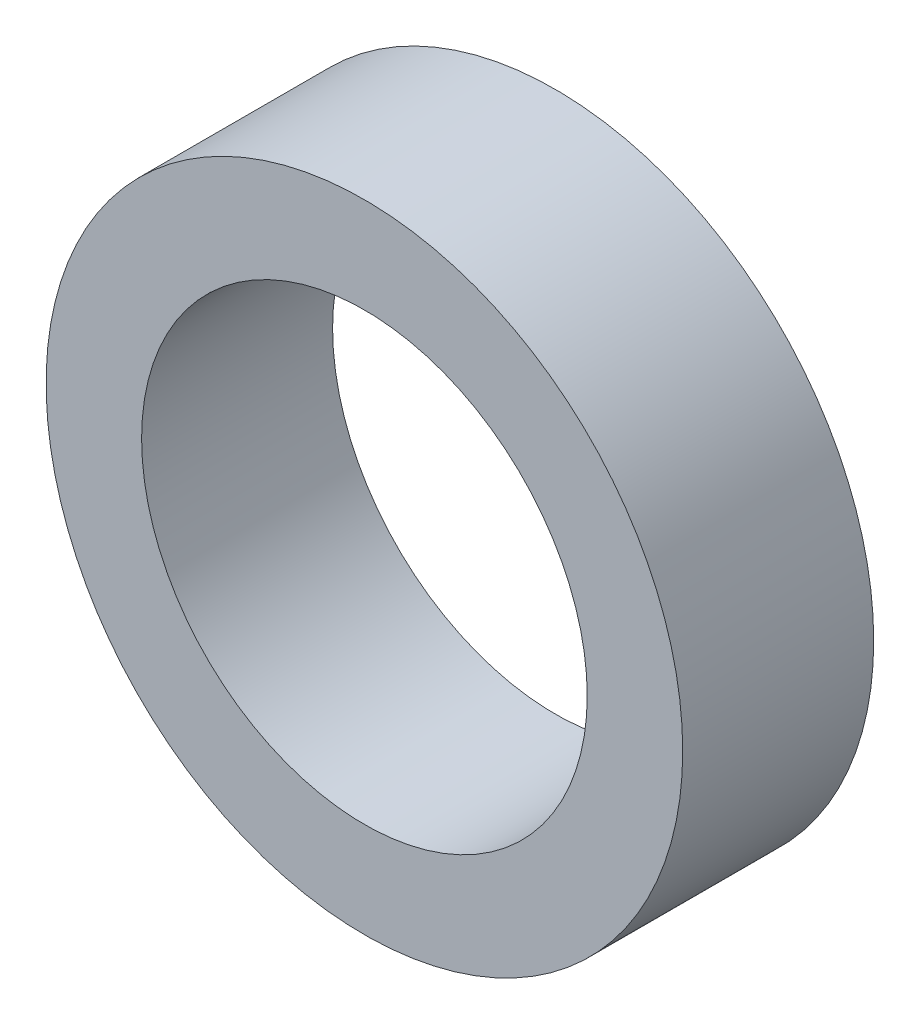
ISO-10303-21;
HEADER;
FILE_DESCRIPTION(('STEP AP214'),'2;1');
FILE_NAME('part.step','',(''),(''),'','','');
FILE_SCHEMA(('AUTOMOTIVE_DESIGN { 1 0 10303 214 1 1 1 1 }'));
ENDSEC;
DATA;
#1=APPLICATION_CONTEXT('core data for automotive mechanical design processes');
#2=APPLICATION_PROTOCOL_DEFINITION('international standard','automotive_design',2000,#1);
#3=PRODUCT_CONTEXT('',#1,'mechanical');
#4=PRODUCT('Part','Part','',(#3));
#5=PRODUCT_RELATED_PRODUCT_CATEGORY('part','',(#4));
#6=PRODUCT_DEFINITION_FORMATION('','',#4);
#7=PRODUCT_DEFINITION_CONTEXT('part definition',#1,'design');
#8=PRODUCT_DEFINITION('design','',#6,#7);
#9=PRODUCT_DEFINITION_SHAPE('','',#8);
#10=(LENGTH_UNIT() NAMED_UNIT(*) SI_UNIT(.MILLI.,.METRE.));
#11=(NAMED_UNIT(*) PLANE_ANGLE_UNIT() SI_UNIT($,.RADIAN.));
#12=(NAMED_UNIT(*) SI_UNIT($,.STERADIAN.) SOLID_ANGLE_UNIT());
#13=UNCERTAINTY_MEASURE_WITH_UNIT(LENGTH_MEASURE(1.E-05),#10,'distance_accuracy_value','');
#14=(GEOMETRIC_REPRESENTATION_CONTEXT(3) GLOBAL_UNCERTAINTY_ASSIGNED_CONTEXT((#13)) GLOBAL_UNIT_ASSIGNED_CONTEXT((#10,
#11,#12)) REPRESENTATION_CONTEXT('',''));
#15=CARTESIAN_POINT('',(0.,0.,0.));
#16=DIRECTION('',(0.,0.,1.));
#17=DIRECTION('',(1.,0.,0.));
#18=AXIS2_PLACEMENT_3D('',#15,#16,#17);
#19=CARTESIAN_POINT('',(0.,0.,1.8));
#20=DIRECTION('',(0.,0.,1.));
#21=DIRECTION('',(1.,0.,0.));
#22=AXIS2_PLACEMENT_3D('',#19,#20,#21);
#23=PLANE('',#22);
#24=CARTESIAN_POINT('',(0.,0.,1.8));
#25=DIRECTION('',(0.,0.,1.));
#26=DIRECTION('',(1.,0.,0.));
#27=AXIS2_PLACEMENT_3D('',#24,#25,#26);
#28=CIRCLE('',#27,3.);
#29=CARTESIAN_POINT('',(3.,0.,1.8));
#30=VERTEX_POINT('',#29);
#31=EDGE_CURVE('E10',#30,#30,#28,.T.);
#32=ORIENTED_EDGE('',*,*,#31,.T.);
#33=EDGE_LOOP('',(#32));
#34=FACE_BOUND('',#33,.T.);
#35=CARTESIAN_POINT('',(0.,0.,1.8));
#36=DIRECTION('',(0.,0.,1.));
#37=DIRECTION('',(1.,0.,0.));
#38=AXIS2_PLACEMENT_3D('',#35,#36,#37);
#39=CIRCLE('',#38,2.1);
#40=CARTESIAN_POINT('',(2.1,0.,1.8));
#41=VERTEX_POINT('',#40);
#42=EDGE_CURVE('E42',#41,#41,#39,.T.);
#43=ORIENTED_EDGE('',*,*,#42,.F.);
#44=EDGE_LOOP('',(#43));
#45=FACE_BOUND('',#44,.T.);
#46=ADVANCED_FACE('F31',(#34,#45),#23,.T.);
#47=CARTESIAN_POINT('',(0.,0.,0.));
#48=DIRECTION('',(0.,0.,1.));
#49=DIRECTION('',(1.,0.,0.));
#50=AXIS2_PLACEMENT_3D('',#47,#48,#49);
#51=PLANE('',#50);
#52=CARTESIAN_POINT('',(0.,0.,0.));
#53=DIRECTION('',(0.,0.,1.));
#54=DIRECTION('',(1.,0.,0.));
#55=AXIS2_PLACEMENT_3D('',#52,#53,#54);
#56=CIRCLE('',#55,3.);
#57=CARTESIAN_POINT('',(3.,0.,0.));
#58=VERTEX_POINT('',#57);
#59=EDGE_CURVE('E38',#58,#58,#56,.T.);
#60=ORIENTED_EDGE('',*,*,#59,.F.);
#61=EDGE_LOOP('',(#60));
#62=FACE_BOUND('',#61,.T.);
#63=CARTESIAN_POINT('',(0.,0.,0.));
#64=DIRECTION('',(0.,0.,1.));
#65=DIRECTION('',(1.,0.,0.));
#66=AXIS2_PLACEMENT_3D('',#63,#64,#65);
#67=CIRCLE('',#66,2.1);
#68=CARTESIAN_POINT('',(2.1,0.,0.));
#69=VERTEX_POINT('',#68);
#70=EDGE_CURVE('E46',#69,#69,#67,.T.);
#71=ORIENTED_EDGE('',*,*,#70,.T.);
#72=EDGE_LOOP('',(#71));
#73=FACE_BOUND('',#72,.T.);
#74=ADVANCED_FACE('F52',(#62,#73),#51,.F.);
#75=CARTESIAN_POINT('',(0.,0.,1.8));
#76=DIRECTION('',(0.,0.,-1.));
#77=DIRECTION('',(-1.,0.,0.));
#78=AXIS2_PLACEMENT_3D('',#75,#76,#77);
#79=CYLINDRICAL_SURFACE('',#78,3.);
#80=ORIENTED_EDGE('',*,*,#31,.F.);
#81=EDGE_LOOP('',(#80));
#82=FACE_BOUND('',#81,.T.);
#83=ORIENTED_EDGE('',*,*,#59,.T.);
#84=EDGE_LOOP('',(#83));
#85=FACE_BOUND('',#84,.T.);
#86=ADVANCED_FACE('F33',(#82,#85),#79,.T.);
#87=CARTESIAN_POINT('',(0.,0.,1.8));
#88=DIRECTION('',(0.,0.,-1.));
#89=DIRECTION('',(-1.,0.,0.));
#90=AXIS2_PLACEMENT_3D('',#87,#88,#89);
#91=CYLINDRICAL_SURFACE('',#90,2.1);
#92=ORIENTED_EDGE('',*,*,#42,.T.);
#93=EDGE_LOOP('',(#92));
#94=FACE_BOUND('',#93,.T.);
#95=ORIENTED_EDGE('',*,*,#70,.F.);
#96=EDGE_LOOP('',(#95));
#97=FACE_BOUND('',#96,.T.);
#98=ADVANCED_FACE('F54',(#94,#97),#91,.F.);
#99=CLOSED_SHELL('',(#46,#74,#86,#98));
#100=MANIFOLD_SOLID_BREP('B2',#99);
#101=ADVANCED_BREP_SHAPE_REPRESENTATION('',(#18,#100),#14);
#102=SHAPE_DEFINITION_REPRESENTATION(#9,#101);
ENDSEC;
END-ISO-10303-21;
